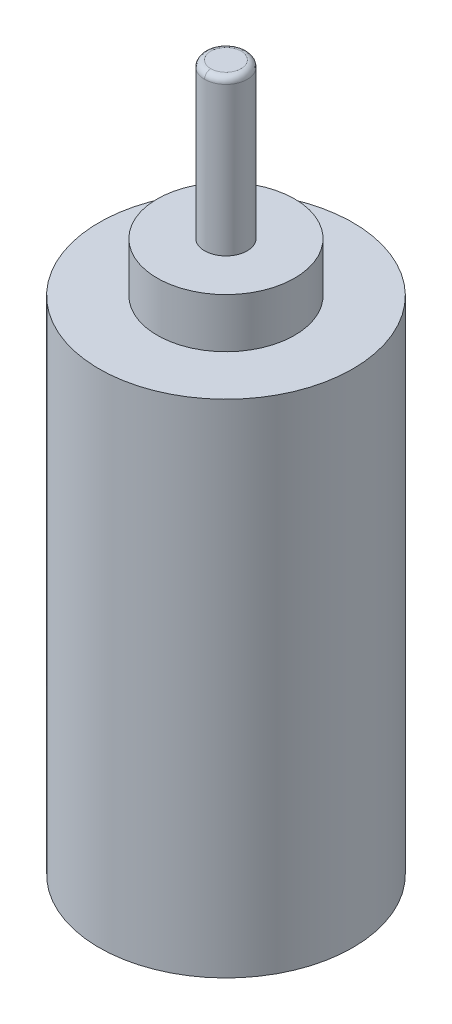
ISO-10303-21;
HEADER;
FILE_DESCRIPTION(('STEP AP214'),'2;1');
FILE_NAME('part.step','',(''),(''),'','','');
FILE_SCHEMA(('AUTOMOTIVE_DESIGN { 1 0 10303 214 1 1 1 1 }'));
ENDSEC;
DATA;
#1=APPLICATION_CONTEXT('core data for automotive mechanical design processes');
#2=APPLICATION_PROTOCOL_DEFINITION('international standard','automotive_design',2000,#1);
#3=PRODUCT_CONTEXT('',#1,'mechanical');
#4=PRODUCT('Part','Part','',(#3));
#5=PRODUCT_RELATED_PRODUCT_CATEGORY('part','',(#4));
#6=PRODUCT_DEFINITION_FORMATION('','',#4);
#7=PRODUCT_DEFINITION_CONTEXT('part definition',#1,'design');
#8=PRODUCT_DEFINITION('design','',#6,#7);
#9=PRODUCT_DEFINITION_SHAPE('','',#8);
#10=(LENGTH_UNIT() NAMED_UNIT(*) SI_UNIT(.MILLI.,.METRE.));
#11=(NAMED_UNIT(*) PLANE_ANGLE_UNIT() SI_UNIT($,.RADIAN.));
#12=(NAMED_UNIT(*) SI_UNIT($,.STERADIAN.) SOLID_ANGLE_UNIT());
#13=UNCERTAINTY_MEASURE_WITH_UNIT(LENGTH_MEASURE(1.E-05),#10,'distance_accuracy_value','');
#14=(GEOMETRIC_REPRESENTATION_CONTEXT(3) GLOBAL_UNCERTAINTY_ASSIGNED_CONTEXT((#13)) GLOBAL_UNIT_ASSIGNED_CONTEXT((#10,
#11,#12)) REPRESENTATION_CONTEXT('',''));
#15=CARTESIAN_POINT('',(0.,0.,0.));
#16=DIRECTION('',(0.,0.,1.));
#17=DIRECTION('',(1.,0.,0.));
#18=AXIS2_PLACEMENT_3D('',#15,#16,#17);
#19=CARTESIAN_POINT('',(0.2608575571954,-1.7,61.91465219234));
#20=DIRECTION('',(0.,-1.,0.));
#21=DIRECTION('',(0.,0.,1.));
#22=AXIS2_PLACEMENT_3D('',#19,#20,#21);
#23=PLANE('',#22);
#24=CARTESIAN_POINT('',(0.,-1.70000000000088,62.175));
#25=DIRECTION('',(0.,-1.,0.));
#26=DIRECTION('',(0.,0.,1.));
#27=AXIS2_PLACEMENT_3D('',#24,#25,#26);
#28=CIRCLE('',#27,0.2449995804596);
#29=CARTESIAN_POINT('',(0.,-1.7000000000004,61.9300003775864));
#30=VERTEX_POINT('',#29);
#31=CARTESIAN_POINT('',(0.,-1.70000000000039,62.4199996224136));
#32=VERTEX_POINT('',#31);
#33=EDGE_CURVE('E43',#30,#32,#28,.F.);
#34=ORIENTED_EDGE('',*,*,#33,.T.);
#35=CARTESIAN_POINT('',(0.,-1.70000000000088,62.175));
#36=DIRECTION('',(0.,-1.,0.));
#37=DIRECTION('',(0.,0.,-1.));
#38=AXIS2_PLACEMENT_3D('',#35,#36,#37);
#39=CIRCLE('',#38,0.244999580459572);
#40=EDGE_CURVE('E49',#32,#30,#39,.F.);
#41=ORIENTED_EDGE('',*,*,#40,.T.);
#42=EDGE_LOOP('',(#34,#41));
#43=FACE_BOUND('',#42,.T.);
#44=ADVANCED_FACE('F16',(#43),#23,.F.);
#45=CARTESIAN_POINT('',(-0.018580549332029,-1.70117579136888,62.4039575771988));
#46=CARTESIAN_POINT('',(-0.0244942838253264,-1.6898642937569,62.4768291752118));
#47=CARTESIAN_POINT('',(-0.0287257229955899,-1.74217622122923,62.5289708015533));
#48=CARTESIAN_POINT('',(-0.0278108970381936,-1.81528762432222,62.5176979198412));
#49=(BOUNDED_CURVE() B_SPLINE_CURVE(3,(#45,#46,#47,#48),.UNSPECIFIED.,.F.,
.F.) B_SPLINE_CURVE_WITH_KNOTS((4,4),(0.,1.),
.UNSPECIFIED.) CURVE() GEOMETRIC_REPRESENTATION_ITEM() RATIONAL_B_SPLINE_CURVE((1.,
0.727124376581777,0.727124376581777,1.)) REPRESENTATION_ITEM(''));
#50=CARTESIAN_POINT('',(0.,-1.8,62.175));
#51=DIRECTION('',(0.,-1.,0.));
#52=AXIS1_PLACEMENT('',#50,#51);
#53=SURFACE_OF_REVOLUTION('',#49,#52);
#54=CARTESIAN_POINT('',(0.,-1.8,62.175));
#55=DIRECTION('',(0.,-1.,0.));
#56=DIRECTION('',(0.,0.,1.));
#57=AXIS2_PLACEMENT_3D('',#54,#55,#56);
#58=CIRCLE('',#57,0.344999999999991);
#59=CARTESIAN_POINT('',(0.,-1.8,62.5199999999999));
#60=VERTEX_POINT('',#59);
#61=CARTESIAN_POINT('',(0.,-1.8,61.8300000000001));
#62=VERTEX_POINT('',#61);
#63=EDGE_CURVE('E34',#60,#62,#58,.F.);
#64=ORIENTED_EDGE('',*,*,#63,.T.);
#65=CARTESIAN_POINT('',(0.,-1.80000000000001,61.9300000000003));
#66=DIRECTION('',(1.,0.,0.));
#67=DIRECTION('',(0.,0.,-1.));
#68=AXIS2_PLACEMENT_3D('',#65,#66,#67);
#69=CIRCLE('',#68,0.100000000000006);
#70=EDGE_CURVE('E54',#62,#30,#69,.T.);
#71=ORIENTED_EDGE('',*,*,#70,.T.);
#72=ORIENTED_EDGE('',*,*,#40,.F.);
#73=CARTESIAN_POINT('',(0.,-1.8,62.4199999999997));
#74=DIRECTION('',(1.,0.,0.));
#75=DIRECTION('',(0.,0.,-1.));
#76=AXIS2_PLACEMENT_3D('',#73,#74,#75);
#77=CIRCLE('',#76,0.100000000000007);
#78=EDGE_CURVE('E52',#32,#60,#77,.T.);
#79=ORIENTED_EDGE('',*,*,#78,.T.);
#80=EDGE_LOOP('',(#64,#71,#72,#79));
#81=FACE_BOUND('',#80,.T.);
#82=ADVANCED_FACE('F51',(#81),#53,.T.);
#83=CARTESIAN_POINT('',(2.132,-13.1,60.043));
#84=DIRECTION('',(0.,-1.,0.));
#85=DIRECTION('',(0.,0.,1.));
#86=AXIS2_PLACEMENT_3D('',#83,#84,#85);
#87=PLANE('',#86);
#88=CARTESIAN_POINT('',(0.,-13.1,62.175));
#89=DIRECTION('',(0.,-1.,0.));
#90=DIRECTION('',(1.,0.,0.));
#91=AXIS2_PLACEMENT_3D('',#88,#89,#90);
#92=CIRCLE('',#91,2.04999999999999);
#93=CARTESIAN_POINT('',(2.04999999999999,-13.1,62.175));
#94=VERTEX_POINT('',#93);
#95=EDGE_CURVE('E20',#94,#94,#92,.T.);
#96=ORIENTED_EDGE('',*,*,#95,.T.);
#97=EDGE_LOOP('',(#96));
#98=FACE_BOUND('',#97,.T.);
#99=ADVANCED_FACE('F82',(#98),#87,.T.);
#100=CARTESIAN_POINT('',(0.018580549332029,-1.70117579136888,61.9460424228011));
#101=CARTESIAN_POINT('',(0.0244942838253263,-1.6898642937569,61.8731708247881));
#102=CARTESIAN_POINT('',(0.0287257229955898,-1.74217622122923,61.8210291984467));
#103=CARTESIAN_POINT('',(0.0278108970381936,-1.81528762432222,61.8323020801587));
#104=(BOUNDED_CURVE() B_SPLINE_CURVE(3,(#100,#101,#102,#103),.UNSPECIFIED.,.F.,
.F.) B_SPLINE_CURVE_WITH_KNOTS((4,4),(0.,1.),
.UNSPECIFIED.) CURVE() GEOMETRIC_REPRESENTATION_ITEM() RATIONAL_B_SPLINE_CURVE((1.,
0.727124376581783,0.727124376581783,1.)) REPRESENTATION_ITEM(''));
#105=CARTESIAN_POINT('',(0.,-1.8,62.175));
#106=DIRECTION('',(0.,-1.,0.));
#107=AXIS1_PLACEMENT('',#105,#106);
#108=SURFACE_OF_REVOLUTION('',#104,#107);
#109=CARTESIAN_POINT('',(0.,-1.8,62.175));
#110=DIRECTION('',(0.,-1.,0.));
#111=DIRECTION('',(0.,0.,1.));
#112=AXIS2_PLACEMENT_3D('',#109,#110,#111);
#113=CIRCLE('',#112,0.344999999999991);
#114=EDGE_CURVE('E60',#62,#60,#113,.F.);
#115=ORIENTED_EDGE('',*,*,#114,.T.);
#116=ORIENTED_EDGE('',*,*,#78,.F.);
#117=ORIENTED_EDGE('',*,*,#33,.F.);
#118=ORIENTED_EDGE('',*,*,#70,.F.);
#119=EDGE_LOOP('',(#115,#116,#117,#118));
#120=FACE_BOUND('',#119,.T.);
#121=ADVANCED_FACE('F59',(#120),#108,.T.);
#122=CARTESIAN_POINT('',(0.,-5.,62.175));
#123=DIRECTION('',(0.,-1.,0.));
#124=DIRECTION('',(1.,0.,0.));
#125=AXIS2_PLACEMENT_3D('',#122,#123,#124);
#126=CYLINDRICAL_SURFACE('',#125,2.04999999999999);
#127=CARTESIAN_POINT('',(0.,-5.,62.175));
#128=DIRECTION('',(0.,-1.,0.));
#129=DIRECTION('',(1.,0.,0.));
#130=AXIS2_PLACEMENT_3D('',#127,#128,#129);
#131=CIRCLE('',#130,2.04999999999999);
#132=CARTESIAN_POINT('',(2.04999999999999,-5.,62.175));
#133=VERTEX_POINT('',#132);
#134=EDGE_CURVE('E96',#133,#133,#131,.T.);
#135=ORIENTED_EDGE('',*,*,#134,.T.);
#136=EDGE_LOOP('',(#135));
#137=FACE_BOUND('',#136,.T.);
#138=ORIENTED_EDGE('',*,*,#95,.F.);
#139=EDGE_LOOP('',(#138));
#140=FACE_BOUND('',#139,.T.);
#141=ADVANCED_FACE('F119',(#137,#140),#126,.T.);
#142=CARTESIAN_POINT('',(0.,-1.8,62.175));
#143=DIRECTION('',(0.,-1.,0.));
#144=DIRECTION('',(0.,0.,-1.));
#145=AXIS2_PLACEMENT_3D('',#142,#143,#144);
#146=CYLINDRICAL_SURFACE('',#145,0.344999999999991);
#147=CARTESIAN_POINT('',(0.,-4.2,62.175));
#148=DIRECTION('',(0.,-1.,0.));
#149=DIRECTION('',(0.,0.,-1.));
#150=AXIS2_PLACEMENT_3D('',#147,#148,#149);
#151=CIRCLE('',#150,0.344999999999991);
#152=CARTESIAN_POINT('',(0.,-4.2,61.83));
#153=VERTEX_POINT('',#152);
#154=EDGE_CURVE('E94',#153,#153,#151,.F.);
#155=ORIENTED_EDGE('',*,*,#154,.T.);
#156=EDGE_LOOP('',(#155));
#157=FACE_BOUND('',#156,.T.);
#158=ORIENTED_EDGE('',*,*,#63,.F.);
#159=ORIENTED_EDGE('',*,*,#114,.F.);
#160=EDGE_LOOP('',(#158,#159));
#161=FACE_BOUND('',#160,.T.);
#162=ADVANCED_FACE('F138',(#157,#161),#146,.T.);
#163=CARTESIAN_POINT('',(2.132,-5.,60.043));
#164=DIRECTION('',(0.,-1.,0.));
#165=DIRECTION('',(0.,0.,1.));
#166=AXIS2_PLACEMENT_3D('',#163,#164,#165);
#167=PLANE('',#166);
#168=CARTESIAN_POINT('',(0.,-5.,62.175));
#169=DIRECTION('',(0.,-1.,0.));
#170=DIRECTION('',(0.,0.,-1.));
#171=AXIS2_PLACEMENT_3D('',#168,#169,#170);
#172=CIRCLE('',#171,1.10999999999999);
#173=CARTESIAN_POINT('',(0.,-5.,61.065));
#174=VERTEX_POINT('',#173);
#175=EDGE_CURVE('E26',#174,#174,#172,.T.);
#176=ORIENTED_EDGE('',*,*,#175,.T.);
#177=EDGE_LOOP('',(#176));
#178=FACE_BOUND('',#177,.T.);
#179=ORIENTED_EDGE('',*,*,#134,.F.);
#180=EDGE_LOOP('',(#179));
#181=FACE_BOUND('',#180,.T.);
#182=ADVANCED_FACE('F141',(#178,#181),#167,.F.);
#183=CARTESIAN_POINT('',(1.1544,-4.2,61.0206));
#184=DIRECTION('',(0.,-1.,0.));
#185=DIRECTION('',(0.,0.,1.));
#186=AXIS2_PLACEMENT_3D('',#183,#184,#185);
#187=PLANE('',#186);
#188=ORIENTED_EDGE('',*,*,#154,.F.);
#189=EDGE_LOOP('',(#188));
#190=FACE_BOUND('',#189,.T.);
#191=CARTESIAN_POINT('',(0.,-4.2,62.175));
#192=DIRECTION('',(0.,-1.,0.));
#193=DIRECTION('',(0.,0.,-1.));
#194=AXIS2_PLACEMENT_3D('',#191,#192,#193);
#195=CIRCLE('',#194,1.10999999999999);
#196=CARTESIAN_POINT('',(0.,-4.2,61.065));
#197=VERTEX_POINT('',#196);
#198=EDGE_CURVE('E11',#197,#197,#195,.F.);
#199=ORIENTED_EDGE('',*,*,#198,.T.);
#200=EDGE_LOOP('',(#199));
#201=FACE_BOUND('',#200,.T.);
#202=ADVANCED_FACE('F18',(#190,#201),#187,.F.);
#203=CARTESIAN_POINT('',(0.,-4.2,62.175));
#204=DIRECTION('',(0.,-1.,0.));
#205=DIRECTION('',(0.,0.,-1.));
#206=AXIS2_PLACEMENT_3D('',#203,#204,#205);
#207=CYLINDRICAL_SURFACE('',#206,1.10999999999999);
#208=ORIENTED_EDGE('',*,*,#198,.F.);
#209=EDGE_LOOP('',(#208));
#210=FACE_BOUND('',#209,.T.);
#211=ORIENTED_EDGE('',*,*,#175,.F.);
#212=EDGE_LOOP('',(#211));
#213=FACE_BOUND('',#212,.T.);
#214=ADVANCED_FACE('F143',(#210,#213),#207,.T.);
#215=CLOSED_SHELL('',(#44,#82,#99,#121,#141,#162,#182,#202,#214));
#216=MANIFOLD_SOLID_BREP('B1',#215);
#217=ADVANCED_BREP_SHAPE_REPRESENTATION('',(#18,#216),#14);
#218=SHAPE_DEFINITION_REPRESENTATION(#9,#217);
ENDSEC;
END-ISO-10303-21;
